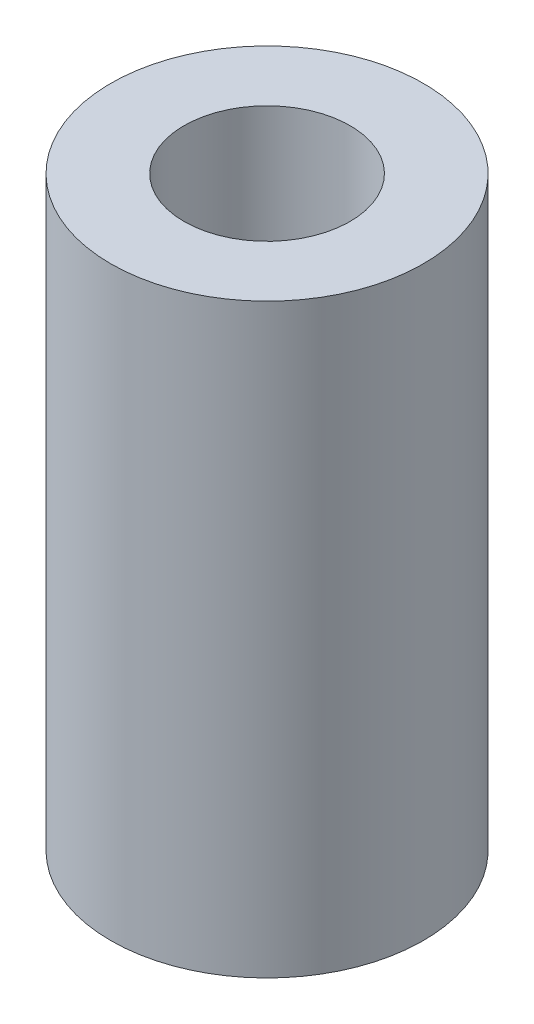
from build123d import *

# Parameters (mm, degrees)
ESQUISSE1_R        = 4
ESQUISSE1_R_2      = 2.125
BOSS_EXTRU_1_DEPTH = 7.5


with BuildPart() as part:
    # Esquisse1 → Boss.-Extru.1 (new, symmetric)
    with BuildSketch(Plane(origin=(0, 0, 0), x_dir=(1, 0, 0), z_dir=(0, 1, 0))):
        with Locations(Location((0, 0, 0), (0, 0, 270))):
            Circle(ESQUISSE1_R)
        with Locations(Location((0, 0, 0), (0, 0, 270))):
            Circle(ESQUISSE1_R_2, mode=Mode.SUBTRACT)
    extrude(amount=BOSS_EXTRU_1_DEPTH, both=True)


solid = part.part
